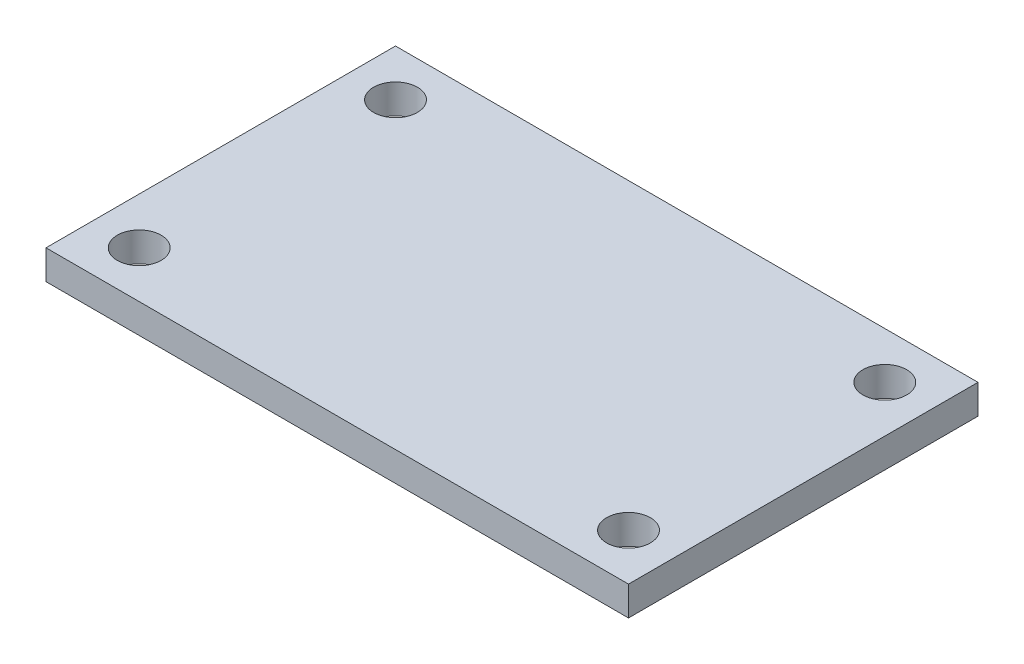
from build123d import *

# Parameters (mm, degrees)
SKETCH1_W           = 31.75
SKETCH1_H           = 19.05
SKETCH1_R           = 1.1938
BOSS_EXTRUDE1_DEPTH = 1.6


with BuildPart() as part:
    # Sketch1 → Boss-Extrude1 (new body)
    with BuildSketch(Plane(origin=(0, 0, 0), x_dir=(1, 0, 0), z_dir=(0, 1, 0))):
        Rectangle(SKETCH1_W, SKETCH1_H)
        with Locations(Location((13.335, 6.985, 0), (0, 0, 270))):
            Circle(SKETCH1_R, mode=Mode.SUBTRACT)
        with Locations(Location((13.335, -6.985, 0), (0, 0, 270))):
            Circle(SKETCH1_R, mode=Mode.SUBTRACT)
        with Locations(Location((-13.335, -6.985, 0), (0, 0, 270))):
            Circle(SKETCH1_R, mode=Mode.SUBTRACT)
        with Locations(Location((-13.335, 6.985, 0), (0, 0, 270))):
            Circle(SKETCH1_R, mode=Mode.SUBTRACT)
    extrude(amount=BOSS_EXTRUDE1_DEPTH)


solid = part.part
